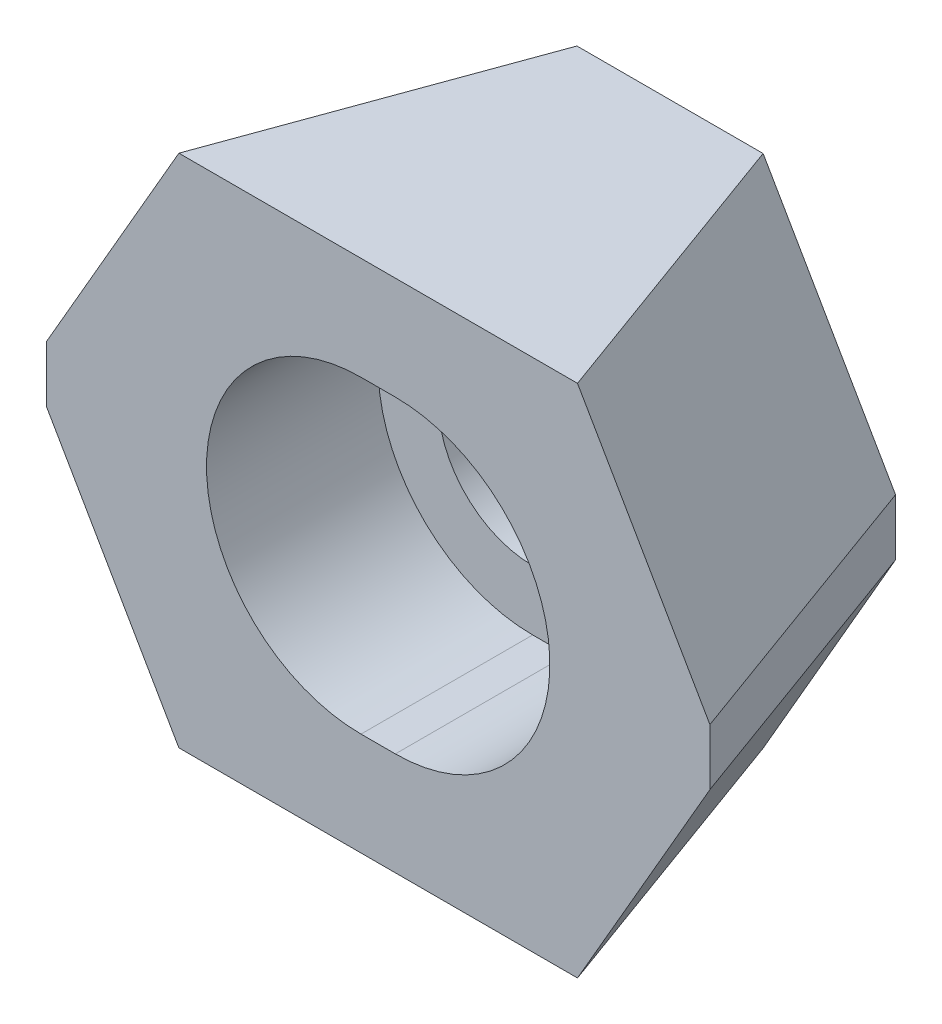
ISO-10303-21;
HEADER;
FILE_DESCRIPTION(('STEP AP214'),'2;1');
FILE_NAME('part.step','',(''),(''),'','','');
FILE_SCHEMA(('AUTOMOTIVE_DESIGN { 1 0 10303 214 1 1 1 1 }'));
ENDSEC;
DATA;
#1=APPLICATION_CONTEXT('core data for automotive mechanical design processes');
#2=APPLICATION_PROTOCOL_DEFINITION('international standard','automotive_design',2000,#1);
#3=PRODUCT_CONTEXT('',#1,'mechanical');
#4=PRODUCT('Part','Part','',(#3));
#5=PRODUCT_RELATED_PRODUCT_CATEGORY('part','',(#4));
#6=PRODUCT_DEFINITION_FORMATION('','',#4);
#7=PRODUCT_DEFINITION_CONTEXT('part definition',#1,'design');
#8=PRODUCT_DEFINITION('design','',#6,#7);
#9=PRODUCT_DEFINITION_SHAPE('','',#8);
#10=(LENGTH_UNIT() NAMED_UNIT(*) SI_UNIT(.MILLI.,.METRE.));
#11=(NAMED_UNIT(*) PLANE_ANGLE_UNIT() SI_UNIT($,.RADIAN.));
#12=(NAMED_UNIT(*) SI_UNIT($,.STERADIAN.) SOLID_ANGLE_UNIT());
#13=UNCERTAINTY_MEASURE_WITH_UNIT(LENGTH_MEASURE(1.E-05),#10,'distance_accuracy_value','');
#14=(GEOMETRIC_REPRESENTATION_CONTEXT(3) GLOBAL_UNCERTAINTY_ASSIGNED_CONTEXT((#13)) GLOBAL_UNIT_ASSIGNED_CONTEXT((#10,
#11,#12)) REPRESENTATION_CONTEXT('',''));
#15=CARTESIAN_POINT('',(0.,0.,0.));
#16=DIRECTION('',(0.,0.,1.));
#17=DIRECTION('',(1.,0.,0.));
#18=AXIS2_PLACEMENT_3D('',#15,#16,#17);
#19=CARTESIAN_POINT('',(-0.82759248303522,-2.75,8.5));
#20=DIRECTION('',(0.,-1.,0.));
#21=DIRECTION('',(1.,0.,0.));
#22=AXIS2_PLACEMENT_3D('',#19,#20,#21);
#23=PLANE('',#22);
#24=DIRECTION('',(0.,0.,1.));
#25=VECTOR('',#24,1.);
#26=CARTESIAN_POINT('',(-0.5,-2.75,-6.15790685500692));
#27=LINE('',#26,#25);
#28=CARTESIAN_POINT('',(-0.5,-2.75,0.));
#29=VERTEX_POINT('',#28);
#30=CARTESIAN_POINT('',(-0.5,-2.75,3.5));
#31=VERTEX_POINT('',#30);
#32=EDGE_CURVE('E129',#29,#31,#27,.T.);
#33=ORIENTED_EDGE('',*,*,#32,.T.);
#34=DIRECTION('',(-1.,0.,0.));
#35=VECTOR('',#34,1.);
#36=CARTESIAN_POINT('',(-0.82759248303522,-2.75,3.5));
#37=LINE('',#36,#35);
#38=CARTESIAN_POINT('',(0.5,-2.75,3.5));
#39=VERTEX_POINT('',#38);
#40=EDGE_CURVE('E240',#39,#31,#37,.T.);
#41=ORIENTED_EDGE('',*,*,#40,.F.);
#42=DIRECTION('',(0.,0.,1.));
#43=VECTOR('',#42,1.);
#44=CARTESIAN_POINT('',(0.5,-2.75,-6.15790685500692));
#45=LINE('',#44,#43);
#46=CARTESIAN_POINT('',(0.5,-2.75,0.));
#47=VERTEX_POINT('',#46);
#48=EDGE_CURVE('E131',#47,#39,#45,.T.);
#49=ORIENTED_EDGE('',*,*,#48,.F.);
#50=DIRECTION('',(-1.,0.,0.));
#51=VECTOR('',#50,1.);
#52=CARTESIAN_POINT('',(-0.82759248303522,-2.75,0.));
#53=LINE('',#52,#51);
#54=EDGE_CURVE('E125',#47,#29,#53,.T.);
#55=ORIENTED_EDGE('',*,*,#54,.T.);
#56=EDGE_LOOP('',(#33,#41,#49,#55));
#57=FACE_BOUND('',#56,.T.);
#58=ADVANCED_FACE('F14',(#57),#23,.F.);
#59=CARTESIAN_POINT('',(0.775978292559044,2.75,8.5));
#60=DIRECTION('',(0.,1.,0.));
#61=DIRECTION('',(0.,0.,1.));
#62=AXIS2_PLACEMENT_3D('',#59,#60,#61);
#63=PLANE('',#62);
#64=DIRECTION('',(1.,0.,0.));
#65=VECTOR('',#64,1.);
#66=CARTESIAN_POINT('',(0.775978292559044,2.75,3.5));
#67=LINE('',#66,#65);
#68=CARTESIAN_POINT('',(-0.5,2.75,3.5));
#69=VERTEX_POINT('',#68);
#70=CARTESIAN_POINT('',(0.5,2.75,3.5));
#71=VERTEX_POINT('',#70);
#72=EDGE_CURVE('E29',#69,#71,#67,.T.);
#73=ORIENTED_EDGE('',*,*,#72,.F.);
#74=DIRECTION('',(0.,0.,1.));
#75=VECTOR('',#74,1.);
#76=CARTESIAN_POINT('',(-0.5,2.75,-6.15790685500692));
#77=LINE('',#76,#75);
#78=CARTESIAN_POINT('',(-0.5,2.75,0.));
#79=VERTEX_POINT('',#78);
#80=EDGE_CURVE('E33',#79,#69,#77,.T.);
#81=ORIENTED_EDGE('',*,*,#80,.F.);
#82=DIRECTION('',(1.,0.,0.));
#83=VECTOR('',#82,1.);
#84=CARTESIAN_POINT('',(0.775978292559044,2.75,0.));
#85=LINE('',#84,#83);
#86=CARTESIAN_POINT('',(0.5,2.75,0.));
#87=VERTEX_POINT('',#86);
#88=EDGE_CURVE('E134',#79,#87,#85,.T.);
#89=ORIENTED_EDGE('',*,*,#88,.T.);
#90=DIRECTION('',(0.,0.,1.));
#91=VECTOR('',#90,1.);
#92=CARTESIAN_POINT('',(0.5,2.75,-6.15790685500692));
#93=LINE('',#92,#91);
#94=EDGE_CURVE('E152',#87,#71,#93,.T.);
#95=ORIENTED_EDGE('',*,*,#94,.T.);
#96=EDGE_LOOP('',(#73,#81,#89,#95));
#97=FACE_BOUND('',#96,.T.);
#98=ADVANCED_FACE('F299',(#97),#63,.F.);
#99=CARTESIAN_POINT('',(-0.5,0.,3.5));
#100=DIRECTION('',(0.,0.,1.));
#101=DIRECTION('',(1.,0.,0.));
#102=AXIS2_PLACEMENT_3D('',#99,#100,#101);
#103=PLANE('',#102);
#104=CARTESIAN_POINT('',(-0.5,0.,3.5));
#105=DIRECTION('',(0.,0.,-1.));
#106=DIRECTION('',(1.,0.,0.));
#107=AXIS2_PLACEMENT_3D('',#104,#105,#106);
#108=CIRCLE('',#107,2.75);
#109=EDGE_CURVE('E144',#31,#69,#108,.T.);
#110=ORIENTED_EDGE('',*,*,#109,.T.);
#111=ORIENTED_EDGE('',*,*,#72,.T.);
#112=CARTESIAN_POINT('',(0.5,0.,3.5));
#113=DIRECTION('',(0.,0.,-1.));
#114=DIRECTION('',(1.,0.,0.));
#115=AXIS2_PLACEMENT_3D('',#112,#113,#114);
#116=CIRCLE('',#115,2.75);
#117=EDGE_CURVE('E149',#71,#39,#116,.T.);
#118=ORIENTED_EDGE('',*,*,#117,.T.);
#119=ORIENTED_EDGE('',*,*,#40,.T.);
#120=EDGE_LOOP('',(#110,#111,#118,#119));
#121=FACE_BOUND('',#120,.T.);
#122=DIRECTION('',(1.,0.,0.));
#123=VECTOR('',#122,1.);
#124=CARTESIAN_POINT('',(-0.918770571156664,-4.5,3.5));
#125=LINE('',#124,#123);
#126=CARTESIAN_POINT('',(-0.5,-4.5,3.5));
#127=VERTEX_POINT('',#126);
#128=CARTESIAN_POINT('',(0.5,-4.5,3.5));
#129=VERTEX_POINT('',#128);
#130=EDGE_CURVE('E224',#127,#129,#125,.T.);
#131=ORIENTED_EDGE('',*,*,#130,.T.);
#132=CARTESIAN_POINT('',(0.5,0.,3.5));
#133=DIRECTION('',(0.,0.,-1.));
#134=DIRECTION('',(1.,0.,0.));
#135=AXIS2_PLACEMENT_3D('',#132,#133,#134);
#136=CIRCLE('',#135,4.5);
#137=CARTESIAN_POINT('',(0.5,4.5,3.5));
#138=VERTEX_POINT('',#137);
#139=EDGE_CURVE('E158',#138,#129,#136,.T.);
#140=ORIENTED_EDGE('',*,*,#139,.F.);
#141=DIRECTION('',(-1.,0.,0.));
#142=VECTOR('',#141,1.);
#143=CARTESIAN_POINT('',(0.852860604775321,4.5,3.5));
#144=LINE('',#143,#142);
#145=CARTESIAN_POINT('',(-0.5,4.5,3.5));
#146=VERTEX_POINT('',#145);
#147=EDGE_CURVE('E227',#138,#146,#144,.T.);
#148=ORIENTED_EDGE('',*,*,#147,.T.);
#149=CARTESIAN_POINT('',(-0.5,0.,3.5));
#150=DIRECTION('',(0.,0.,-1.));
#151=DIRECTION('',(1.,0.,0.));
#152=AXIS2_PLACEMENT_3D('',#149,#150,#151);
#153=CIRCLE('',#152,4.5);
#154=EDGE_CURVE('E169',#127,#146,#153,.T.);
#155=ORIENTED_EDGE('',*,*,#154,.F.);
#156=EDGE_LOOP('',(#131,#140,#148,#155));
#157=FACE_BOUND('',#156,.T.);
#158=ADVANCED_FACE('F305',(#121,#157),#103,.T.);
#159=CARTESIAN_POINT('',(0.852860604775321,4.5,3.5));
#160=DIRECTION('',(0.,1.,0.));
#161=DIRECTION('',(0.,0.,1.));
#162=AXIS2_PLACEMENT_3D('',#159,#160,#161);
#163=PLANE('',#162);
#164=DIRECTION('',(0.,0.,-1.));
#165=VECTOR('',#164,1.);
#166=CARTESIAN_POINT('',(0.5,4.5,18.5710162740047));
#167=LINE('',#166,#165);
#168=CARTESIAN_POINT('',(0.5,4.5,8.5));
#169=VERTEX_POINT('',#168);
#170=EDGE_CURVE('E156',#169,#138,#167,.T.);
#171=ORIENTED_EDGE('',*,*,#170,.F.);
#172=DIRECTION('',(-1.,0.,0.));
#173=VECTOR('',#172,1.);
#174=CARTESIAN_POINT('',(0.852860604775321,4.5,8.5));
#175=LINE('',#174,#173);
#176=CARTESIAN_POINT('',(-0.5,4.5,8.5));
#177=VERTEX_POINT('',#176);
#178=EDGE_CURVE('E222',#169,#177,#175,.T.);
#179=ORIENTED_EDGE('',*,*,#178,.T.);
#180=DIRECTION('',(0.,0.,-1.));
#181=VECTOR('',#180,1.);
#182=CARTESIAN_POINT('',(-0.5,4.5,18.5710162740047));
#183=LINE('',#182,#181);
#184=EDGE_CURVE('E172',#177,#146,#183,.T.);
#185=ORIENTED_EDGE('',*,*,#184,.T.);
#186=ORIENTED_EDGE('',*,*,#147,.F.);
#187=EDGE_LOOP('',(#171,#179,#185,#186));
#188=FACE_BOUND('',#187,.T.);
#189=ADVANCED_FACE('F331',(#188),#163,.F.);
#190=CARTESIAN_POINT('',(-0.918770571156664,-4.5,3.5));
#191=DIRECTION('',(0.,-1.,0.));
#192=DIRECTION('',(0.,0.,-1.));
#193=AXIS2_PLACEMENT_3D('',#190,#191,#192);
#194=PLANE('',#193);
#195=DIRECTION('',(1.,0.,0.));
#196=VECTOR('',#195,1.);
#197=CARTESIAN_POINT('',(-0.918770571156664,-4.5,8.5));
#198=LINE('',#197,#196);
#199=CARTESIAN_POINT('',(-0.5,-4.5,8.5));
#200=VERTEX_POINT('',#199);
#201=CARTESIAN_POINT('',(0.5,-4.5,8.5));
#202=VERTEX_POINT('',#201);
#203=EDGE_CURVE('E220',#200,#202,#198,.T.);
#204=ORIENTED_EDGE('',*,*,#203,.T.);
#205=DIRECTION('',(0.,0.,-1.));
#206=VECTOR('',#205,1.);
#207=CARTESIAN_POINT('',(0.5,-4.5,18.5710162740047));
#208=LINE('',#207,#206);
#209=EDGE_CURVE('E161',#202,#129,#208,.T.);
#210=ORIENTED_EDGE('',*,*,#209,.T.);
#211=ORIENTED_EDGE('',*,*,#130,.F.);
#212=DIRECTION('',(0.,0.,-1.));
#213=VECTOR('',#212,1.);
#214=CARTESIAN_POINT('',(-0.5,-4.5,18.5710162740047));
#215=LINE('',#214,#213);
#216=EDGE_CURVE('E165',#200,#127,#215,.T.);
#217=ORIENTED_EDGE('',*,*,#216,.F.);
#218=EDGE_LOOP('',(#204,#210,#211,#217));
#219=FACE_BOUND('',#218,.T.);
#220=ADVANCED_FACE('F316',(#219),#194,.F.);
#221=CARTESIAN_POINT('',(-6.99632742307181,10.5,0.));
#222=DIRECTION('',(0.,0.,-1.));
#223=DIRECTION('',(-1.,0.,0.));
#224=AXIS2_PLACEMENT_3D('',#221,#222,#223);
#225=PLANE('',#224);
#226=ORIENTED_EDGE('',*,*,#88,.F.);
#227=CARTESIAN_POINT('',(-0.5,0.,0.));
#228=DIRECTION('',(0.,0.,-1.));
#229=DIRECTION('',(-1.,0.,0.));
#230=AXIS2_PLACEMENT_3D('',#227,#228,#229);
#231=CIRCLE('',#230,2.75);
#232=EDGE_CURVE('E137',#29,#79,#231,.T.);
#233=ORIENTED_EDGE('',*,*,#232,.F.);
#234=ORIENTED_EDGE('',*,*,#54,.F.);
#235=CARTESIAN_POINT('',(0.5,0.,0.));
#236=DIRECTION('',(0.,0.,-1.));
#237=DIRECTION('',(-1.,0.,0.));
#238=AXIS2_PLACEMENT_3D('',#235,#236,#237);
#239=CIRCLE('',#238,2.75);
#240=EDGE_CURVE('E153',#87,#47,#239,.T.);
#241=ORIENTED_EDGE('',*,*,#240,.F.);
#242=EDGE_LOOP('',(#226,#233,#234,#241));
#243=FACE_BOUND('',#242,.T.);
#244=DIRECTION('',(0.,1.,0.));
#245=VECTOR('',#244,1.);
#246=CARTESIAN_POINT('',(6.56779766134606,10.5,0.));
#247=LINE('',#246,#245);
#248=CARTESIAN_POINT('',(6.56779766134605,-0.820000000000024,0.));
#249=VERTEX_POINT('',#248);
#250=CARTESIAN_POINT('',(6.56779766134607,0.819999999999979,0.));
#251=VERTEX_POINT('',#250);
#252=EDGE_CURVE('E197',#249,#251,#247,.T.);
#253=ORIENTED_EDGE('',*,*,#252,.F.);
#254=DIRECTION('',(-0.5,-0.866025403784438,0.));
#255=VECTOR('',#254,1.);
#256=CARTESIAN_POINT('',(8.0784701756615,1.79656154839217,0.));
#257=LINE('',#256,#255);
#258=CARTESIAN_POINT('',(2.71109786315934,-7.5,0.));
#259=VERTEX_POINT('',#258);
#260=EDGE_CURVE('E188',#249,#259,#257,.T.);
#261=ORIENTED_EDGE('',*,*,#260,.T.);
#262=DIRECTION('',(1.,0.,0.));
#263=VECTOR('',#262,1.);
#264=CARTESIAN_POINT('',(-6.99632742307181,-7.5,0.));
#265=LINE('',#264,#263);
#266=CARTESIAN_POINT('',(-2.71109786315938,-7.5,0.));
#267=VERTEX_POINT('',#266);
#268=EDGE_CURVE('E233',#267,#259,#265,.T.);
#269=ORIENTED_EDGE('',*,*,#268,.F.);
#270=DIRECTION('',(0.5,-0.866025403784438,0.));
#271=VECTOR('',#270,1.);
#272=CARTESIAN_POINT('',(-11.5766338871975,7.85555882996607,0.));
#273=LINE('',#272,#271);
#274=CARTESIAN_POINT('',(-6.5677976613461,-0.82,0.));
#275=VERTEX_POINT('',#274);
#276=EDGE_CURVE('E214',#275,#267,#273,.T.);
#277=ORIENTED_EDGE('',*,*,#276,.F.);
#278=DIRECTION('',(0.,-1.,0.));
#279=VECTOR('',#278,1.);
#280=CARTESIAN_POINT('',(-6.56779766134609,10.5,0.));
#281=LINE('',#280,#279);
#282=CARTESIAN_POINT('',(-6.56779766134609,0.82,0.));
#283=VERTEX_POINT('',#282);
#284=EDGE_CURVE('E217',#283,#275,#281,.T.);
#285=ORIENTED_EDGE('',*,*,#284,.F.);
#286=DIRECTION('',(0.5,0.866025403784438,0.));
#287=VECTOR('',#286,1.);
#288=CARTESIAN_POINT('',(-2.48336714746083,7.89444117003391,0.));
#289=LINE('',#288,#287);
#290=CARTESIAN_POINT('',(-2.71109786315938,7.5,0.));
#291=VERTEX_POINT('',#290);
#292=EDGE_CURVE('E208',#283,#291,#289,.T.);
#293=ORIENTED_EDGE('',*,*,#292,.T.);
#294=DIRECTION('',(-1.,0.,0.));
#295=VECTOR('',#294,1.);
#296=CARTESIAN_POINT('',(-6.99632742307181,7.5,0.));
#297=LINE('',#296,#295);
#298=CARTESIAN_POINT('',(2.71109786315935,7.5,0.));
#299=VERTEX_POINT('',#298);
#300=EDGE_CURVE('E231',#299,#291,#297,.T.);
#301=ORIENTED_EDGE('',*,*,#300,.F.);
#302=DIRECTION('',(-0.5,0.866025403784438,0.));
#303=VECTOR('',#302,1.);
#304=CARTESIAN_POINT('',(-1.01479656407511,13.9534384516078,0.));
#305=LINE('',#304,#303);
#306=EDGE_CURVE('E194',#251,#299,#305,.T.);
#307=ORIENTED_EDGE('',*,*,#306,.F.);
#308=EDGE_LOOP('',(#253,#261,#269,#277,#285,#293,#301,#307));
#309=FACE_BOUND('',#308,.T.);
#310=ADVANCED_FACE('F16',(#243,#309),#225,.T.);
#311=CARTESIAN_POINT('',(14.,10.5,8.5));
#312=DIRECTION('',(0.,0.,1.));
#313=DIRECTION('',(1.,0.,0.));
#314=AXIS2_PLACEMENT_3D('',#311,#312,#313);
#315=PLANE('',#314);
#316=ORIENTED_EDGE('',*,*,#178,.F.);
#317=CARTESIAN_POINT('',(0.5,0.,8.5));
#318=DIRECTION('',(0.,0.,1.));
#319=DIRECTION('',(1.,0.,0.));
#320=AXIS2_PLACEMENT_3D('',#317,#318,#319);
#321=CIRCLE('',#320,4.5);
#322=EDGE_CURVE('E162',#169,#202,#321,.F.);
#323=ORIENTED_EDGE('',*,*,#322,.T.);
#324=ORIENTED_EDGE('',*,*,#203,.F.);
#325=CARTESIAN_POINT('',(-0.5,0.,8.5));
#326=DIRECTION('',(0.,0.,1.));
#327=DIRECTION('',(1.,0.,0.));
#328=AXIS2_PLACEMENT_3D('',#325,#326,#327);
#329=CIRCLE('',#328,4.5);
#330=EDGE_CURVE('E173',#200,#177,#329,.F.);
#331=ORIENTED_EDGE('',*,*,#330,.T.);
#332=EDGE_LOOP('',(#316,#323,#324,#331));
#333=FACE_BOUND('',#332,.T.);
#334=DIRECTION('',(-1.,0.,0.));
#335=VECTOR('',#334,1.);
#336=CARTESIAN_POINT('',(14.,-7.5,8.5));
#337=LINE('',#336,#335);
#338=CARTESIAN_POINT('',(5.80484485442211,-7.5,8.5));
#339=VERTEX_POINT('',#338);
#340=CARTESIAN_POINT('',(-5.80484485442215,-7.5,8.5));
#341=VERTEX_POINT('',#340);
#342=EDGE_CURVE('E235',#339,#341,#337,.T.);
#343=ORIENTED_EDGE('',*,*,#342,.F.);
#344=DIRECTION('',(0.5,0.866025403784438,0.));
#345=VECTOR('',#344,1.);
#346=CARTESIAN_POINT('',(15.6478622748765,9.54860627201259,8.5));
#347=LINE('',#346,#345);
#348=CARTESIAN_POINT('',(9.66154465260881,-0.820000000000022,8.5));
#349=VERTEX_POINT('',#348);
#350=EDGE_CURVE('E184',#339,#349,#347,.T.);
#351=ORIENTED_EDGE('',*,*,#350,.T.);
#352=DIRECTION('',(0.,-1.,0.));
#353=VECTOR('',#352,1.);
#354=CARTESIAN_POINT('',(9.66154465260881,10.5,8.5));
#355=LINE('',#354,#353);
#356=CARTESIAN_POINT('',(9.66154465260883,0.819999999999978,8.5));
#357=VERTEX_POINT('',#356);
#358=EDGE_CURVE('E9',#357,#349,#355,.T.);
#359=ORIENTED_EDGE('',*,*,#358,.F.);
#360=DIRECTION('',(0.5,-0.866025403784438,0.));
#361=VECTOR('',#360,1.);
#362=CARTESIAN_POINT('',(6.55459553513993,6.20139372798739,8.5));
#363=LINE('',#362,#361);
#364=CARTESIAN_POINT('',(5.80484485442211,7.5,8.5));
#365=VERTEX_POINT('',#364);
#366=EDGE_CURVE('E191',#365,#357,#363,.T.);
#367=ORIENTED_EDGE('',*,*,#366,.F.);
#368=DIRECTION('',(1.,0.,0.));
#369=VECTOR('',#368,1.);
#370=CARTESIAN_POINT('',(14.,7.5,8.5));
#371=LINE('',#370,#369);
#372=CARTESIAN_POINT('',(-5.80484485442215,7.5,8.5));
#373=VERTEX_POINT('',#372);
#374=EDGE_CURVE('E237',#373,#365,#371,.T.);
#375=ORIENTED_EDGE('',*,*,#374,.F.);
#376=DIRECTION('',(-0.5,-0.866025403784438,0.));
#377=VECTOR('',#376,1.);
#378=CARTESIAN_POINT('',(0.445404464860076,18.3257493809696,8.5));
#379=LINE('',#378,#377);
#380=CARTESIAN_POINT('',(-9.66154465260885,0.82,8.5));
#381=VERTEX_POINT('',#380);
#382=EDGE_CURVE('E204',#373,#381,#379,.T.);
#383=ORIENTED_EDGE('',*,*,#382,.T.);
#384=DIRECTION('',(0.,1.,0.));
#385=VECTOR('',#384,1.);
#386=CARTESIAN_POINT('',(-9.66154465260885,10.5,8.5));
#387=LINE('',#386,#385);
#388=CARTESIAN_POINT('',(-9.66154465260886,-0.82,8.5));
#389=VERTEX_POINT('',#388);
#390=EDGE_CURVE('E247',#389,#381,#387,.T.);
#391=ORIENTED_EDGE('',*,*,#390,.F.);
#392=DIRECTION('',(-0.5,0.866025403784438,0.));
#393=VECTOR('',#392,1.);
#394=CARTESIAN_POINT('',(-8.64786227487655,-2.57574938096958,8.5));
#395=LINE('',#394,#393);
#396=EDGE_CURVE('E211',#341,#389,#395,.T.);
#397=ORIENTED_EDGE('',*,*,#396,.F.);
#398=EDGE_LOOP('',(#343,#351,#359,#367,#375,#383,#391,#397));
#399=FACE_BOUND('',#398,.T.);
#400=ADVANCED_FACE('F274',(#333,#399),#315,.T.);
#401=CARTESIAN_POINT('',(-5.68732591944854,-7.5,14.7648908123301));
#402=DIRECTION('',(0.,1.,0.));
#403=DIRECTION('',(0.,0.,1.));
#404=AXIS2_PLACEMENT_3D('',#401,#402,#403);
#405=PLANE('',#404);
#406=DIRECTION('',(-0.342020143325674,0.,-0.939692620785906));
#407=VECTOR('',#406,1.);
#408=CARTESIAN_POINT('',(6.47401334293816,-7.5,10.3385253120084));
#409=LINE('',#408,#407);
#410=EDGE_CURVE('E250',#339,#259,#409,.T.);
#411=ORIENTED_EDGE('',*,*,#410,.F.);
#412=ORIENTED_EDGE('',*,*,#342,.T.);
#413=DIRECTION('',(0.342020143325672,0.,-0.939692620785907));
#414=VECTOR('',#413,1.);
#415=CARTESIAN_POINT('',(-7.80459484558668,-7.5,13.9942679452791));
#416=LINE('',#415,#414);
#417=EDGE_CURVE('E245',#341,#267,#416,.T.);
#418=ORIENTED_EDGE('',*,*,#417,.T.);
#419=ORIENTED_EDGE('',*,*,#268,.T.);
#420=EDGE_LOOP('',(#411,#412,#418,#419));
#421=FACE_BOUND('',#420,.T.);
#422=ADVANCED_FACE('F271',(#421),#405,.F.);
#423=CARTESIAN_POINT('',(19.0211449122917,7.5,12.295355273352));
#424=DIRECTION('',(0.,-1.,0.));
#425=DIRECTION('',(0.,0.,-1.));
#426=AXIS2_PLACEMENT_3D('',#423,#424,#425);
#427=PLANE('',#426);
#428=ORIENTED_EDGE('',*,*,#374,.T.);
#429=DIRECTION('',(-0.342020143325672,0.,-0.939692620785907));
#430=VECTOR('',#429,1.);
#431=CARTESIAN_POINT('',(8.57066194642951,7.5,16.0990200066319));
#432=LINE('',#431,#430);
#433=EDGE_CURVE('E22',#365,#299,#432,.T.);
#434=ORIENTED_EDGE('',*,*,#433,.T.);
#435=ORIENTED_EDGE('',*,*,#300,.T.);
#436=DIRECTION('',(0.342020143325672,0.,-0.939692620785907));
#437=VECTOR('',#436,1.);
#438=CARTESIAN_POINT('',(-4.12055939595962,7.5,3.87246373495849));
#439=LINE('',#438,#437);
#440=EDGE_CURVE('E242',#373,#291,#439,.T.);
#441=ORIENTED_EDGE('',*,*,#440,.F.);
#442=EDGE_LOOP('',(#428,#434,#435,#441));
#443=FACE_BOUND('',#442,.T.);
#444=ADVANCED_FACE('F255',(#443),#427,.F.);
#445=CARTESIAN_POINT('',(11.0312533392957,10.5,-32.9980291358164));
#446=DIRECTION('',(-0.825964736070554,0.476870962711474,-0.300626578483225));
#447=DIRECTION('',(-0.5,-0.866025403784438,0.));
#448=AXIS2_PLACEMENT_3D('',#445,#446,#447);
#449=PLANE('',#448);
#450=ORIENTED_EDGE('',*,*,#292,.F.);
#451=DIRECTION('',(-0.342020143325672,0.,0.939692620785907));
#452=VECTOR('',#451,1.);
#453=CARTESIAN_POINT('',(5.4425027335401,0.82,-32.9980291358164));
#454=LINE('',#453,#452);
#455=EDGE_CURVE('E201',#283,#381,#454,.T.);
#456=ORIENTED_EDGE('',*,*,#455,.T.);
#457=ORIENTED_EDGE('',*,*,#382,.F.);
#458=ORIENTED_EDGE('',*,*,#440,.T.);
#459=EDGE_LOOP('',(#450,#456,#457,#458));
#460=FACE_BOUND('',#459,.T.);
#461=ADVANCED_FACE('F284',(#460),#449,.T.);
#462=CARTESIAN_POINT('',(5.4425027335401,-0.82,-32.9980291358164));
#463=DIRECTION('',(0.939692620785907,0.,0.342020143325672));
#464=DIRECTION('',(0.342020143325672,0.,-0.939692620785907));
#465=AXIS2_PLACEMENT_3D('',#462,#463,#464);
#466=PLANE('',#465);
#467=ORIENTED_EDGE('',*,*,#455,.F.);
#468=ORIENTED_EDGE('',*,*,#284,.T.);
#469=DIRECTION('',(-0.342020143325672,0.,0.939692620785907));
#470=VECTOR('',#469,1.);
#471=CARTESIAN_POINT('',(5.4425027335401,-0.82,-32.9980291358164));
#472=LINE('',#471,#470);
#473=EDGE_CURVE('E200',#275,#389,#472,.T.);
#474=ORIENTED_EDGE('',*,*,#473,.T.);
#475=ORIENTED_EDGE('',*,*,#390,.T.);
#476=EDGE_LOOP('',(#467,#468,#474,#475));
#477=FACE_BOUND('',#476,.T.);
#478=ADVANCED_FACE('F281',(#477),#466,.F.);
#479=CARTESIAN_POINT('',(11.0312533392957,-10.5,-32.9980291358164));
#480=DIRECTION('',(0.825964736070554,0.476870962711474,0.300626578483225));
#481=DIRECTION('',(-0.5,0.866025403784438,0.));
#482=AXIS2_PLACEMENT_3D('',#479,#480,#481);
#483=PLANE('',#482);
#484=ORIENTED_EDGE('',*,*,#473,.F.);
#485=ORIENTED_EDGE('',*,*,#276,.T.);
#486=ORIENTED_EDGE('',*,*,#417,.F.);
#487=ORIENTED_EDGE('',*,*,#396,.T.);
#488=EDGE_LOOP('',(#484,#485,#486,#487));
#489=FACE_BOUND('',#488,.T.);
#490=ADVANCED_FACE('F278',(#489),#483,.F.);
#491=CARTESIAN_POINT('',(-11.0312533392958,-10.5,-32.9980291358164));
#492=DIRECTION('',(0.825964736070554,-0.476870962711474,-0.300626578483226));
#493=DIRECTION('',(0.5,0.866025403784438,0.));
#494=AXIS2_PLACEMENT_3D('',#491,#492,#493);
#495=PLANE('',#494);
#496=ORIENTED_EDGE('',*,*,#260,.F.);
#497=DIRECTION('',(0.342020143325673,0.,0.939692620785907));
#498=VECTOR('',#497,1.);
#499=CARTESIAN_POINT('',(-5.44250273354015,-0.819999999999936,-32.9980291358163));
#500=LINE('',#499,#498);
#501=EDGE_CURVE('E181',#249,#349,#500,.T.);
#502=ORIENTED_EDGE('',*,*,#501,.T.);
#503=ORIENTED_EDGE('',*,*,#350,.F.);
#504=ORIENTED_EDGE('',*,*,#410,.T.);
#505=EDGE_LOOP('',(#496,#502,#503,#504));
#506=FACE_BOUND('',#505,.T.);
#507=ADVANCED_FACE('F267',(#506),#495,.T.);
#508=CARTESIAN_POINT('',(-5.44250273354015,0.820000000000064,-32.9980291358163));
#509=DIRECTION('',(-0.939692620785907,0.,0.342020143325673));
#510=DIRECTION('',(-0.342020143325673,0.,-0.939692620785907));
#511=AXIS2_PLACEMENT_3D('',#508,#509,#510);
#512=PLANE('',#511);
#513=ORIENTED_EDGE('',*,*,#501,.F.);
#514=ORIENTED_EDGE('',*,*,#252,.T.);
#515=DIRECTION('',(0.342020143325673,0.,0.939692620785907));
#516=VECTOR('',#515,1.);
#517=CARTESIAN_POINT('',(-5.44250273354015,0.820000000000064,-32.9980291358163));
#518=LINE('',#517,#516);
#519=EDGE_CURVE('E176',#251,#357,#518,.T.);
#520=ORIENTED_EDGE('',*,*,#519,.T.);
#521=ORIENTED_EDGE('',*,*,#358,.T.);
#522=EDGE_LOOP('',(#513,#514,#520,#521));
#523=FACE_BOUND('',#522,.T.);
#524=ADVANCED_FACE('F263',(#523),#512,.F.);
#525=CARTESIAN_POINT('',(-11.0312533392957,10.5,-32.9980291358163));
#526=DIRECTION('',(-0.825964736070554,-0.476870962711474,0.300626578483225));
#527=DIRECTION('',(0.5,-0.866025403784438,0.));
#528=AXIS2_PLACEMENT_3D('',#525,#526,#527);
#529=PLANE('',#528);
#530=ORIENTED_EDGE('',*,*,#519,.F.);
#531=ORIENTED_EDGE('',*,*,#306,.T.);
#532=ORIENTED_EDGE('',*,*,#433,.F.);
#533=ORIENTED_EDGE('',*,*,#366,.T.);
#534=EDGE_LOOP('',(#530,#531,#532,#533));
#535=FACE_BOUND('',#534,.T.);
#536=ADVANCED_FACE('F260',(#535),#529,.F.);
#537=CARTESIAN_POINT('',(-0.5,0.,18.5710162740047));
#538=DIRECTION('',(0.,0.,-1.));
#539=DIRECTION('',(-1.,0.,0.));
#540=AXIS2_PLACEMENT_3D('',#537,#538,#539);
#541=CYLINDRICAL_SURFACE('',#540,4.5);
#542=ORIENTED_EDGE('',*,*,#330,.F.);
#543=ORIENTED_EDGE('',*,*,#216,.T.);
#544=ORIENTED_EDGE('',*,*,#154,.T.);
#545=ORIENTED_EDGE('',*,*,#184,.F.);
#546=EDGE_LOOP('',(#542,#543,#544,#545));
#547=FACE_BOUND('',#546,.T.);
#548=ADVANCED_FACE('F297',(#547),#541,.F.);
#549=CARTESIAN_POINT('',(0.5,0.,18.5710162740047));
#550=DIRECTION('',(0.,0.,-1.));
#551=DIRECTION('',(-1.,0.,0.));
#552=AXIS2_PLACEMENT_3D('',#549,#550,#551);
#553=CYLINDRICAL_SURFACE('',#552,4.5);
#554=ORIENTED_EDGE('',*,*,#322,.F.);
#555=ORIENTED_EDGE('',*,*,#170,.T.);
#556=ORIENTED_EDGE('',*,*,#139,.T.);
#557=ORIENTED_EDGE('',*,*,#209,.F.);
#558=EDGE_LOOP('',(#554,#555,#556,#557));
#559=FACE_BOUND('',#558,.T.);
#560=ADVANCED_FACE('F324',(#559),#553,.F.);
#561=CARTESIAN_POINT('',(0.5,0.,-6.15790685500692));
#562=DIRECTION('',(0.,0.,1.));
#563=DIRECTION('',(1.,0.,0.));
#564=AXIS2_PLACEMENT_3D('',#561,#562,#563);
#565=CYLINDRICAL_SURFACE('',#564,2.75);
#566=ORIENTED_EDGE('',*,*,#94,.F.);
#567=ORIENTED_EDGE('',*,*,#240,.T.);
#568=ORIENTED_EDGE('',*,*,#48,.T.);
#569=ORIENTED_EDGE('',*,*,#117,.F.);
#570=EDGE_LOOP('',(#566,#567,#568,#569));
#571=FACE_BOUND('',#570,.T.);
#572=ADVANCED_FACE('F359',(#571),#565,.F.);
#573=CARTESIAN_POINT('',(-0.5,0.,-6.15790685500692));
#574=DIRECTION('',(0.,0.,1.));
#575=DIRECTION('',(1.,0.,0.));
#576=AXIS2_PLACEMENT_3D('',#573,#574,#575);
#577=CYLINDRICAL_SURFACE('',#576,2.75);
#578=ORIENTED_EDGE('',*,*,#32,.F.);
#579=ORIENTED_EDGE('',*,*,#232,.T.);
#580=ORIENTED_EDGE('',*,*,#80,.T.);
#581=ORIENTED_EDGE('',*,*,#109,.F.);
#582=EDGE_LOOP('',(#578,#579,#580,#581));
#583=FACE_BOUND('',#582,.T.);
#584=ADVANCED_FACE('F142',(#583),#577,.F.);
#585=CLOSED_SHELL('',(#58,#98,#158,#189,#220,#310,#400,#422,#444,#461,#478,#490,#507,#524,#536,
#548,#560,#572,#584));
#586=MANIFOLD_SOLID_BREP('B1',#585);
#587=ADVANCED_BREP_SHAPE_REPRESENTATION('',(#18,#586),#14);
#588=SHAPE_DEFINITION_REPRESENTATION(#9,#587);
ENDSEC;
END-ISO-10303-21;
